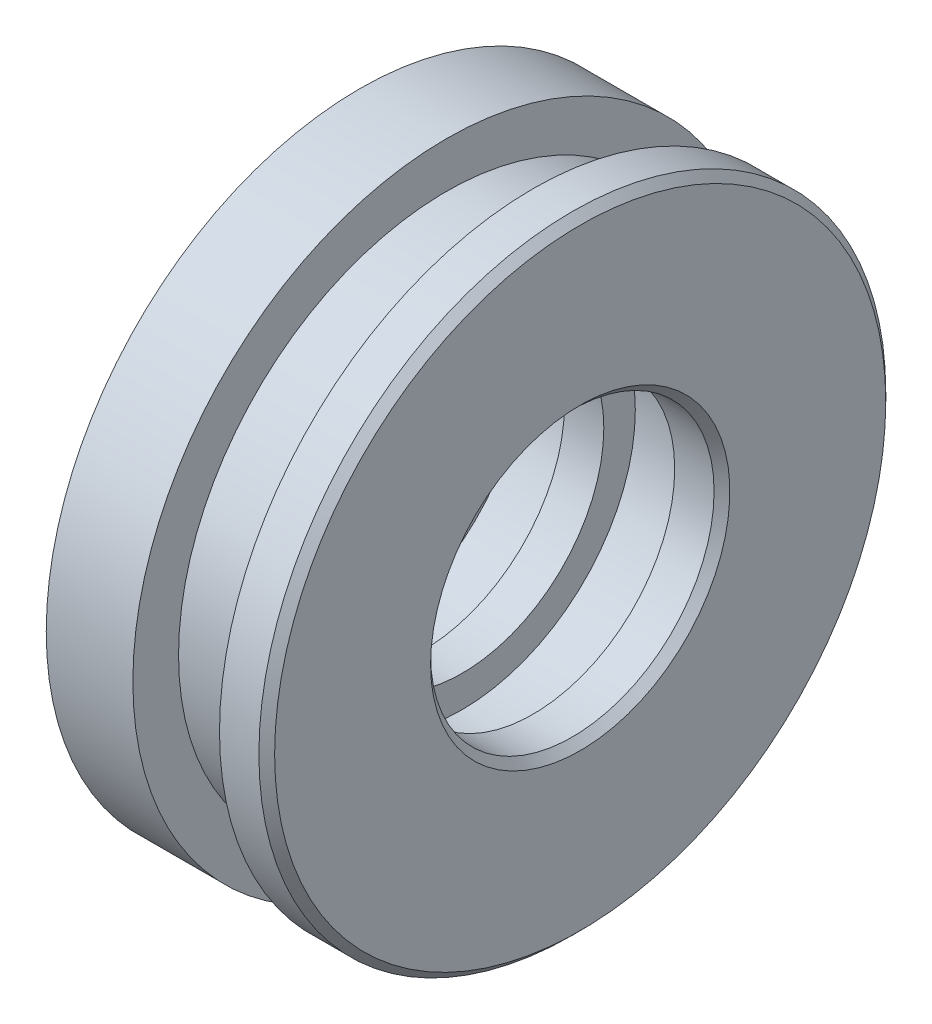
from build123d import *


with BuildPart() as part:
    # Esquisse1 → R_volution1 (revolve)
    with BuildSketch(Plane.XY, mode=Mode.PRIVATE) as r_volution1_sk:
        Polygon((0, 9), (0, 13), (4, 13), (4, 19.9), (9.5, 19.9), (9.5, 17), (15, 17), (15, 19.9), (17.5, 19.9), (18, 19.4), (18, 9.5), (17.5, 9), (15, 9), (15, 11), (10.5, 11), (10.5, 9), (8, 9), (8, 10.5), (4, 10.5), (4, 9), align=None)
    revolve(r_volution1_sk.sketch.rotate(Axis((0, 0, 0), (1, 0, 0)), 90), axis=Axis((0, 0, 0), (1, 0, 0)))


solid = part.part
